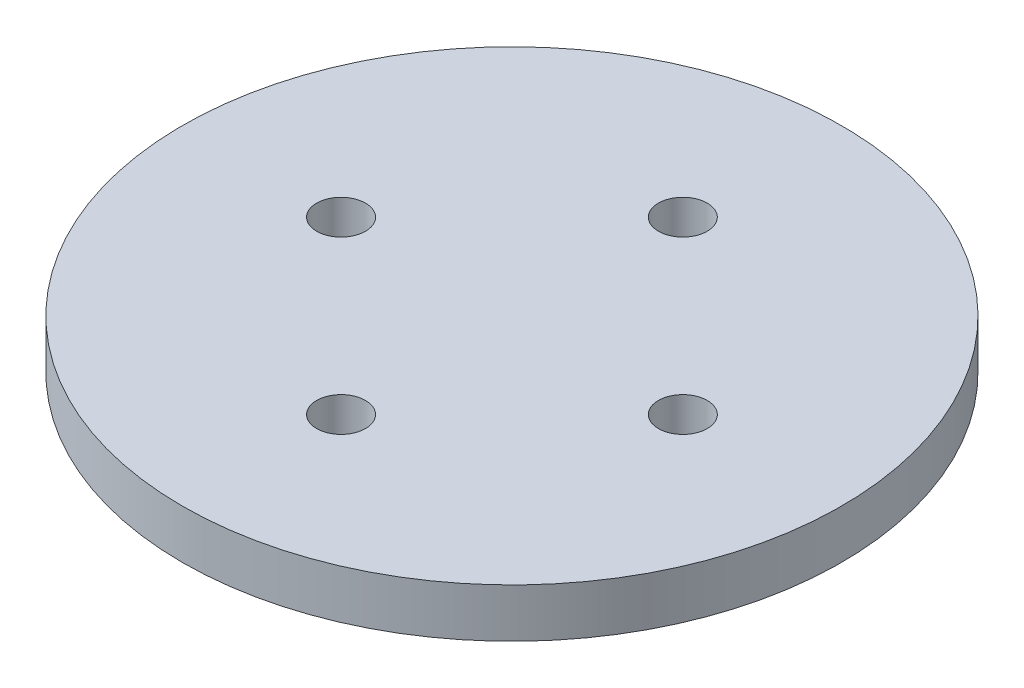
from build123d import *

# Parameters (mm, degrees)
ESQUISSE2_R                  = 1
ENL_V_MAT_EXTRU_1_DEPTH      = 20.32614809
R_P_TITION_CIRCULAIRE1_COUNT = 4


with BuildPart() as part:
    # Esquisse1 → Base-R_volution (revolve)
    with BuildSketch(Plane.XY, mode=Mode.PRIVATE) as base_r_volution_sk:
        Polygon((0, 0), (0, 5), (-13.5, 5), (-13.5, 3), (-3, 3), (-3, 0), align=None)
    revolve(base_r_volution_sk.sketch.rotate(Axis((0, 29.554695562, 0), (0, -1, 0)), 270), axis=Axis((0, 29.554695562, 0), (0, -1, 0)))

    # Esquisse2 → Enl_v. mat.-Extru.1 (cut, through all)
    with BuildSketch(Plane.XZ.offset(-3)):
        with Locations(Location((7, 0, 0), (0, 0, 270))):
            Circle(ESQUISSE2_R)
    enl_v_mat_extru_1 = extrude(amount=-ENL_V_MAT_EXTRU_1_DEPTH, mode=Mode.SUBTRACT)

    # R_p_tition circulaire1: Enl_v. mat.-Extru.1 ×4 about axis
    r_p_tition_circulaire1_axis = Axis((0, 29.554695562, 0), (0, -1, 0))
    for i in range(1, R_P_TITION_CIRCULAIRE1_COUNT):
        add(enl_v_mat_extru_1.rotate(r_p_tition_circulaire1_axis, i * 360 / R_P_TITION_CIRCULAIRE1_COUNT), mode=Mode.SUBTRACT)


solid = part.part
